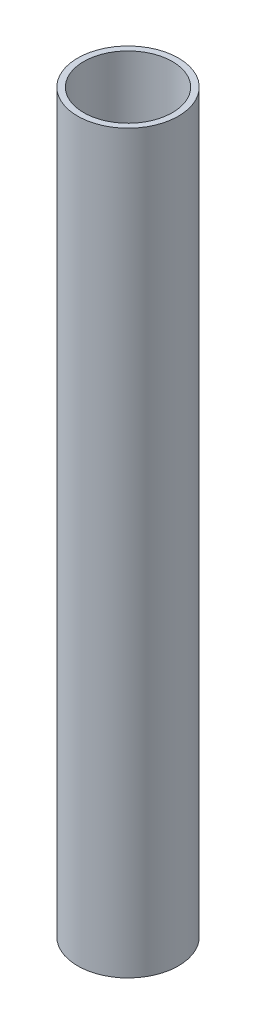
ISO-10303-21;
HEADER;
FILE_DESCRIPTION(('STEP AP214'),'2;1');
FILE_NAME('part.step','',(''),(''),'','','');
FILE_SCHEMA(('AUTOMOTIVE_DESIGN { 1 0 10303 214 1 1 1 1 }'));
ENDSEC;
DATA;
#1=APPLICATION_CONTEXT('core data for automotive mechanical design processes');
#2=APPLICATION_PROTOCOL_DEFINITION('international standard','automotive_design',2000,#1);
#3=PRODUCT_CONTEXT('',#1,'mechanical');
#4=PRODUCT('Part','Part','',(#3));
#5=PRODUCT_RELATED_PRODUCT_CATEGORY('part','',(#4));
#6=PRODUCT_DEFINITION_FORMATION('','',#4);
#7=PRODUCT_DEFINITION_CONTEXT('part definition',#1,'design');
#8=PRODUCT_DEFINITION('design','',#6,#7);
#9=PRODUCT_DEFINITION_SHAPE('','',#8);
#10=(LENGTH_UNIT() NAMED_UNIT(*) SI_UNIT(.MILLI.,.METRE.));
#11=(NAMED_UNIT(*) PLANE_ANGLE_UNIT() SI_UNIT($,.RADIAN.));
#12=(NAMED_UNIT(*) SI_UNIT($,.STERADIAN.) SOLID_ANGLE_UNIT());
#13=UNCERTAINTY_MEASURE_WITH_UNIT(LENGTH_MEASURE(1.E-05),#10,'distance_accuracy_value','');
#14=(GEOMETRIC_REPRESENTATION_CONTEXT(3) GLOBAL_UNCERTAINTY_ASSIGNED_CONTEXT((#13)) GLOBAL_UNIT_ASSIGNED_CONTEXT((#10,
#11,#12)) REPRESENTATION_CONTEXT('',''));
#15=CARTESIAN_POINT('',(0.,0.,0.));
#16=DIRECTION('',(0.,0.,1.));
#17=DIRECTION('',(1.,0.,0.));
#18=AXIS2_PLACEMENT_3D('',#15,#16,#17);
#19=CARTESIAN_POINT('',(0.,122.,0.));
#20=DIRECTION('',(0.,1.,0.));
#21=DIRECTION('',(0.,0.,1.));
#22=AXIS2_PLACEMENT_3D('',#19,#20,#21);
#23=PLANE('',#22);
#24=CARTESIAN_POINT('',(0.,122.,0.));
#25=DIRECTION('',(0.,1.,0.));
#26=DIRECTION('',(0.,0.,1.));
#27=AXIS2_PLACEMENT_3D('',#24,#25,#26);
#28=CIRCLE('',#27,8.35);
#29=CARTESIAN_POINT('',(0.,122.,-8.35));
#30=VERTEX_POINT('',#29);
#31=EDGE_CURVE('E10',#30,#30,#28,.T.);
#32=ORIENTED_EDGE('',*,*,#31,.T.);
#33=EDGE_LOOP('',(#32));
#34=FACE_BOUND('',#33,.T.);
#35=CARTESIAN_POINT('',(0.,122.,0.));
#36=DIRECTION('',(0.,1.,0.));
#37=DIRECTION('',(0.,0.,1.));
#38=AXIS2_PLACEMENT_3D('',#35,#36,#37);
#39=CIRCLE('',#38,7.35);
#40=CARTESIAN_POINT('',(0.,122.,-7.35));
#41=VERTEX_POINT('',#40);
#42=EDGE_CURVE('E56',#41,#41,#39,.T.);
#43=ORIENTED_EDGE('',*,*,#42,.F.);
#44=EDGE_LOOP('',(#43));
#45=FACE_BOUND('',#44,.T.);
#46=ADVANCED_FACE('F43',(#34,#45),#23,.T.);
#47=CARTESIAN_POINT('',(0.,0.,0.));
#48=DIRECTION('',(0.,1.,0.));
#49=DIRECTION('',(0.,0.,1.));
#50=AXIS2_PLACEMENT_3D('',#47,#48,#49);
#51=PLANE('',#50);
#52=CARTESIAN_POINT('',(0.,0.,0.));
#53=DIRECTION('',(0.,1.,0.));
#54=DIRECTION('',(0.,0.,1.));
#55=AXIS2_PLACEMENT_3D('',#52,#53,#54);
#56=CIRCLE('',#55,8.35);
#57=CARTESIAN_POINT('',(0.,0.,-8.35));
#58=VERTEX_POINT('',#57);
#59=EDGE_CURVE('E47',#58,#58,#56,.T.);
#60=ORIENTED_EDGE('',*,*,#59,.F.);
#61=EDGE_LOOP('',(#60));
#62=FACE_BOUND('',#61,.T.);
#63=CARTESIAN_POINT('',(0.,0.,0.));
#64=DIRECTION('',(0.,1.,0.));
#65=DIRECTION('',(0.,0.,1.));
#66=AXIS2_PLACEMENT_3D('',#63,#64,#65);
#67=CIRCLE('',#66,7.35);
#68=CARTESIAN_POINT('',(0.,0.,-7.35));
#69=VERTEX_POINT('',#68);
#70=EDGE_CURVE('E58',#69,#69,#67,.T.);
#71=ORIENTED_EDGE('',*,*,#70,.T.);
#72=EDGE_LOOP('',(#71));
#73=FACE_BOUND('',#72,.T.);
#74=ADVANCED_FACE('F70',(#62,#73),#51,.F.);
#75=CARTESIAN_POINT('',(0.,122.,0.));
#76=DIRECTION('',(0.,-1.,0.));
#77=DIRECTION('',(0.,0.,-1.));
#78=AXIS2_PLACEMENT_3D('',#75,#76,#77);
#79=CYLINDRICAL_SURFACE('',#78,8.35);
#80=CARTESIAN_POINT('',(0.,122.,-8.35));
#81=CARTESIAN_POINT('',(0.,120.729166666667,-8.35));
#82=CARTESIAN_POINT('',(0.,119.458333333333,-8.35));
#83=CARTESIAN_POINT('',(0.,116.916666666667,-8.35));
#84=CARTESIAN_POINT('',(0.,115.645833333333,-8.35));
#85=CARTESIAN_POINT('',(0.,113.104166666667,-8.35));
#86=CARTESIAN_POINT('',(0.,111.833333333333,-8.35));
#87=CARTESIAN_POINT('',(0.,109.291666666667,-8.35));
#88=CARTESIAN_POINT('',(0.,108.020833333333,-8.35));
#89=CARTESIAN_POINT('',(0.,105.479166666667,-8.35));
#90=CARTESIAN_POINT('',(0.,104.208333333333,-8.35));
#91=CARTESIAN_POINT('',(0.,101.666666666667,-8.35));
#92=CARTESIAN_POINT('',(0.,100.395833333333,-8.35));
#93=CARTESIAN_POINT('',(0.,97.8541666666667,-8.35));
#94=CARTESIAN_POINT('',(0.,96.5833333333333,-8.35));
#95=CARTESIAN_POINT('',(0.,94.0416666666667,-8.35));
#96=CARTESIAN_POINT('',(0.,92.7708333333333,-8.35));
#97=CARTESIAN_POINT('',(0.,90.2291666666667,-8.35));
#98=CARTESIAN_POINT('',(0.,88.9583333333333,-8.35));
#99=CARTESIAN_POINT('',(0.,86.4166666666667,-8.35));
#100=CARTESIAN_POINT('',(0.,85.1458333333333,-8.35));
#101=CARTESIAN_POINT('',(0.,82.6041666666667,-8.35));
#102=CARTESIAN_POINT('',(0.,81.3333333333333,-8.35));
#103=CARTESIAN_POINT('',(0.,78.7916666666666,-8.35));
#104=CARTESIAN_POINT('',(0.,77.5208333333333,-8.35));
#105=CARTESIAN_POINT('',(0.,74.9791666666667,-8.35));
#106=CARTESIAN_POINT('',(0.,73.7083333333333,-8.35));
#107=CARTESIAN_POINT('',(0.,71.1666666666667,-8.35));
#108=CARTESIAN_POINT('',(0.,69.8958333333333,-8.35));
#109=CARTESIAN_POINT('',(0.,67.3541666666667,-8.35));
#110=CARTESIAN_POINT('',(0.,66.0833333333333,-8.35));
#111=CARTESIAN_POINT('',(0.,63.5416666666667,-8.35));
#112=CARTESIAN_POINT('',(0.,62.2708333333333,-8.35));
#113=CARTESIAN_POINT('',(0.,59.7291666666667,-8.35));
#114=CARTESIAN_POINT('',(0.,58.4583333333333,-8.35));
#115=CARTESIAN_POINT('',(0.,55.9166666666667,-8.35));
#116=CARTESIAN_POINT('',(0.,54.6458333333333,-8.35));
#117=CARTESIAN_POINT('',(0.,52.1041666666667,-8.35));
#118=CARTESIAN_POINT('',(0.,50.8333333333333,-8.35));
#119=CARTESIAN_POINT('',(0.,48.2916666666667,-8.35));
#120=CARTESIAN_POINT('',(0.,47.0208333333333,-8.35));
#121=CARTESIAN_POINT('',(0.,44.4791666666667,-8.35));
#122=CARTESIAN_POINT('',(0.,43.2083333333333,-8.35));
#123=CARTESIAN_POINT('',(0.,40.6666666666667,-8.35));
#124=CARTESIAN_POINT('',(0.,39.3958333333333,-8.35));
#125=CARTESIAN_POINT('',(0.,36.8541666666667,-8.35));
#126=CARTESIAN_POINT('',(0.,35.5833333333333,-8.35));
#127=CARTESIAN_POINT('',(0.,33.0416666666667,-8.35));
#128=CARTESIAN_POINT('',(0.,31.7708333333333,-8.35));
#129=CARTESIAN_POINT('',(0.,29.2291666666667,-8.35));
#130=CARTESIAN_POINT('',(0.,27.9583333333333,-8.35));
#131=CARTESIAN_POINT('',(0.,25.4166666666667,-8.35));
#132=CARTESIAN_POINT('',(0.,24.1458333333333,-8.35));
#133=CARTESIAN_POINT('',(0.,21.6041666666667,-8.35));
#134=CARTESIAN_POINT('',(0.,20.3333333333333,-8.35));
#135=CARTESIAN_POINT('',(0.,17.7916666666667,-8.35));
#136=CARTESIAN_POINT('',(0.,16.5208333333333,-8.35));
#137=CARTESIAN_POINT('',(0.,13.9791666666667,-8.35));
#138=CARTESIAN_POINT('',(0.,12.7083333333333,-8.35));
#139=CARTESIAN_POINT('',(0.,10.1666666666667,-8.35));
#140=CARTESIAN_POINT('',(0.,8.89583333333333,-8.35));
#141=CARTESIAN_POINT('',(0.,6.35416666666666,-8.35));
#142=CARTESIAN_POINT('',(0.,5.08333333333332,-8.35));
#143=CARTESIAN_POINT('',(0.,2.54166666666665,-8.35));
#144=CARTESIAN_POINT('',(0.,1.27083333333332,-8.35));
#145=CARTESIAN_POINT('',(0.,0.,-8.35));
#146=B_SPLINE_CURVE_WITH_KNOTS('',3,(#80,#81,#82,#83,#84,#85,#86,#87,#88,#89,#90,#91,#92,#93,
#94,#95,#96,#97,#98,#99,#100,#101,#102,#103,#104,#105,#106,#107,#108,#109,#110,#111,#112,#113,
#114,#115,#116,#117,#118,#119,#120,#121,#122,#123,#124,#125,#126,#127,#128,#129,#130,#131,#132,
#133,#134,#135,#136,#137,#138,#139,#140,#141,#142,#143,#144,#145),.UNSPECIFIED.,.F.,.F.,(4,2,2,
2,2,2,2,2,2,2,2,2,2,2,2,2,2,2,2,2,2,2,2,2,2,2,2,2,2,2,2,2,4),(0.,3.81250000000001,
7.62500000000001,11.4375,15.25,19.0625,22.875,26.6875,30.5,34.3125,38.125,41.9375,45.75,49.5625,
53.375,57.1875,61.,64.8125,68.625,72.4375,76.25,80.0625,83.875,87.6875,91.5,95.3125,99.125,
102.9375,106.75,110.5625,114.375,118.1875,122.),.UNSPECIFIED.);
#147=EDGE_CURVE('BSEAM45',#30,#58,#146,.T.);
#148=ORIENTED_EDGE('',*,*,#31,.F.);
#149=ORIENTED_EDGE('',*,*,#59,.T.);
#150=ORIENTED_EDGE('',*,*,#147,.T.);
#151=ORIENTED_EDGE('',*,*,#147,.F.);
#152=EDGE_LOOP('',(#148,#150,#149,#151));
#153=FACE_BOUND('',#152,.T.);
#154=ADVANCED_FACE('F45',(#153),#79,.T.);
#155=CARTESIAN_POINT('',(0.,122.,0.));
#156=DIRECTION('',(0.,-1.,0.));
#157=DIRECTION('',(0.,0.,-1.));
#158=AXIS2_PLACEMENT_3D('',#155,#156,#157);
#159=CYLINDRICAL_SURFACE('',#158,7.35);
#160=CARTESIAN_POINT('',(0.,122.,-7.35));
#161=CARTESIAN_POINT('',(0.,120.729166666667,-7.35));
#162=CARTESIAN_POINT('',(0.,119.458333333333,-7.35));
#163=CARTESIAN_POINT('',(0.,116.916666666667,-7.35));
#164=CARTESIAN_POINT('',(0.,115.645833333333,-7.35));
#165=CARTESIAN_POINT('',(0.,113.104166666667,-7.35));
#166=CARTESIAN_POINT('',(0.,111.833333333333,-7.35));
#167=CARTESIAN_POINT('',(0.,109.291666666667,-7.35));
#168=CARTESIAN_POINT('',(0.,108.020833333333,-7.35));
#169=CARTESIAN_POINT('',(0.,105.479166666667,-7.35));
#170=CARTESIAN_POINT('',(0.,104.208333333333,-7.35));
#171=CARTESIAN_POINT('',(0.,101.666666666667,-7.35));
#172=CARTESIAN_POINT('',(0.,100.395833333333,-7.35));
#173=CARTESIAN_POINT('',(0.,97.8541666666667,-7.35));
#174=CARTESIAN_POINT('',(0.,96.5833333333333,-7.35));
#175=CARTESIAN_POINT('',(0.,94.0416666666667,-7.35));
#176=CARTESIAN_POINT('',(0.,92.7708333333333,-7.35));
#177=CARTESIAN_POINT('',(0.,90.2291666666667,-7.35));
#178=CARTESIAN_POINT('',(0.,88.9583333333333,-7.35));
#179=CARTESIAN_POINT('',(0.,86.4166666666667,-7.35));
#180=CARTESIAN_POINT('',(0.,85.1458333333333,-7.35));
#181=CARTESIAN_POINT('',(0.,82.6041666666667,-7.35));
#182=CARTESIAN_POINT('',(0.,81.3333333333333,-7.35));
#183=CARTESIAN_POINT('',(0.,78.7916666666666,-7.35));
#184=CARTESIAN_POINT('',(0.,77.5208333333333,-7.35));
#185=CARTESIAN_POINT('',(0.,74.9791666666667,-7.35));
#186=CARTESIAN_POINT('',(0.,73.7083333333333,-7.35));
#187=CARTESIAN_POINT('',(0.,71.1666666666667,-7.35));
#188=CARTESIAN_POINT('',(0.,69.8958333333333,-7.35));
#189=CARTESIAN_POINT('',(0.,67.3541666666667,-7.35));
#190=CARTESIAN_POINT('',(0.,66.0833333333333,-7.35));
#191=CARTESIAN_POINT('',(0.,63.5416666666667,-7.35));
#192=CARTESIAN_POINT('',(0.,62.2708333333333,-7.35));
#193=CARTESIAN_POINT('',(0.,59.7291666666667,-7.35));
#194=CARTESIAN_POINT('',(0.,58.4583333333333,-7.35));
#195=CARTESIAN_POINT('',(0.,55.9166666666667,-7.35));
#196=CARTESIAN_POINT('',(0.,54.6458333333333,-7.35));
#197=CARTESIAN_POINT('',(0.,52.1041666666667,-7.35));
#198=CARTESIAN_POINT('',(0.,50.8333333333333,-7.35));
#199=CARTESIAN_POINT('',(0.,48.2916666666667,-7.35));
#200=CARTESIAN_POINT('',(0.,47.0208333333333,-7.35));
#201=CARTESIAN_POINT('',(0.,44.4791666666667,-7.35));
#202=CARTESIAN_POINT('',(0.,43.2083333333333,-7.35));
#203=CARTESIAN_POINT('',(0.,40.6666666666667,-7.35));
#204=CARTESIAN_POINT('',(0.,39.3958333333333,-7.35));
#205=CARTESIAN_POINT('',(0.,36.8541666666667,-7.35));
#206=CARTESIAN_POINT('',(0.,35.5833333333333,-7.35));
#207=CARTESIAN_POINT('',(0.,33.0416666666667,-7.35));
#208=CARTESIAN_POINT('',(0.,31.7708333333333,-7.35));
#209=CARTESIAN_POINT('',(0.,29.2291666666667,-7.35));
#210=CARTESIAN_POINT('',(0.,27.9583333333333,-7.35));
#211=CARTESIAN_POINT('',(0.,25.4166666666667,-7.35));
#212=CARTESIAN_POINT('',(0.,24.1458333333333,-7.35));
#213=CARTESIAN_POINT('',(0.,21.6041666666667,-7.35));
#214=CARTESIAN_POINT('',(0.,20.3333333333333,-7.35));
#215=CARTESIAN_POINT('',(0.,17.7916666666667,-7.35));
#216=CARTESIAN_POINT('',(0.,16.5208333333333,-7.35));
#217=CARTESIAN_POINT('',(0.,13.9791666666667,-7.35));
#218=CARTESIAN_POINT('',(0.,12.7083333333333,-7.35));
#219=CARTESIAN_POINT('',(0.,10.1666666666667,-7.35));
#220=CARTESIAN_POINT('',(0.,8.89583333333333,-7.35));
#221=CARTESIAN_POINT('',(0.,6.35416666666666,-7.35));
#222=CARTESIAN_POINT('',(0.,5.08333333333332,-7.35));
#223=CARTESIAN_POINT('',(0.,2.54166666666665,-7.35));
#224=CARTESIAN_POINT('',(0.,1.27083333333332,-7.35));
#225=CARTESIAN_POINT('',(0.,0.,-7.35));
#226=B_SPLINE_CURVE_WITH_KNOTS('',3,(#160,#161,#162,#163,#164,#165,#166,#167,#168,#169,#170,
#171,#172,#173,#174,#175,#176,#177,#178,#179,#180,#181,#182,#183,#184,#185,#186,#187,#188,#189,
#190,#191,#192,#193,#194,#195,#196,#197,#198,#199,#200,#201,#202,#203,#204,#205,#206,#207,#208,
#209,#210,#211,#212,#213,#214,#215,#216,#217,#218,#219,#220,#221,#222,#223,#224,#225),
.UNSPECIFIED.,.F.,.F.,(4,2,2,2,2,2,2,2,2,2,2,2,2,2,2,2,2,2,2,2,2,2,2,2,2,2,2,2,2,2,2,2,4),(0.,
3.81250000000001,7.62500000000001,11.4375,15.25,19.0625,22.875,26.6875,30.5,34.3125,38.125,
41.9375,45.75,49.5625,53.375,57.1875,61.,64.8125,68.625,72.4375,76.25,80.0625,83.875,87.6875,
91.5,95.3125,99.125,102.9375,106.75,110.5625,114.375,118.1875,122.),.UNSPECIFIED.);
#227=EDGE_CURVE('BSEAM66',#41,#69,#226,.T.);
#228=ORIENTED_EDGE('',*,*,#42,.T.);
#229=ORIENTED_EDGE('',*,*,#70,.F.);
#230=ORIENTED_EDGE('',*,*,#227,.T.);
#231=ORIENTED_EDGE('',*,*,#227,.F.);
#232=EDGE_LOOP('',(#228,#230,#229,#231));
#233=FACE_BOUND('',#232,.T.);
#234=ADVANCED_FACE('F66',(#233),#159,.F.);
#235=CLOSED_SHELL('',(#46,#74,#154,#234));
#236=MANIFOLD_SOLID_BREP('B2',#235);
#237=ADVANCED_BREP_SHAPE_REPRESENTATION('',(#18,#236),#14);
#238=SHAPE_DEFINITION_REPRESENTATION(#9,#237);
ENDSEC;
END-ISO-10303-21;
